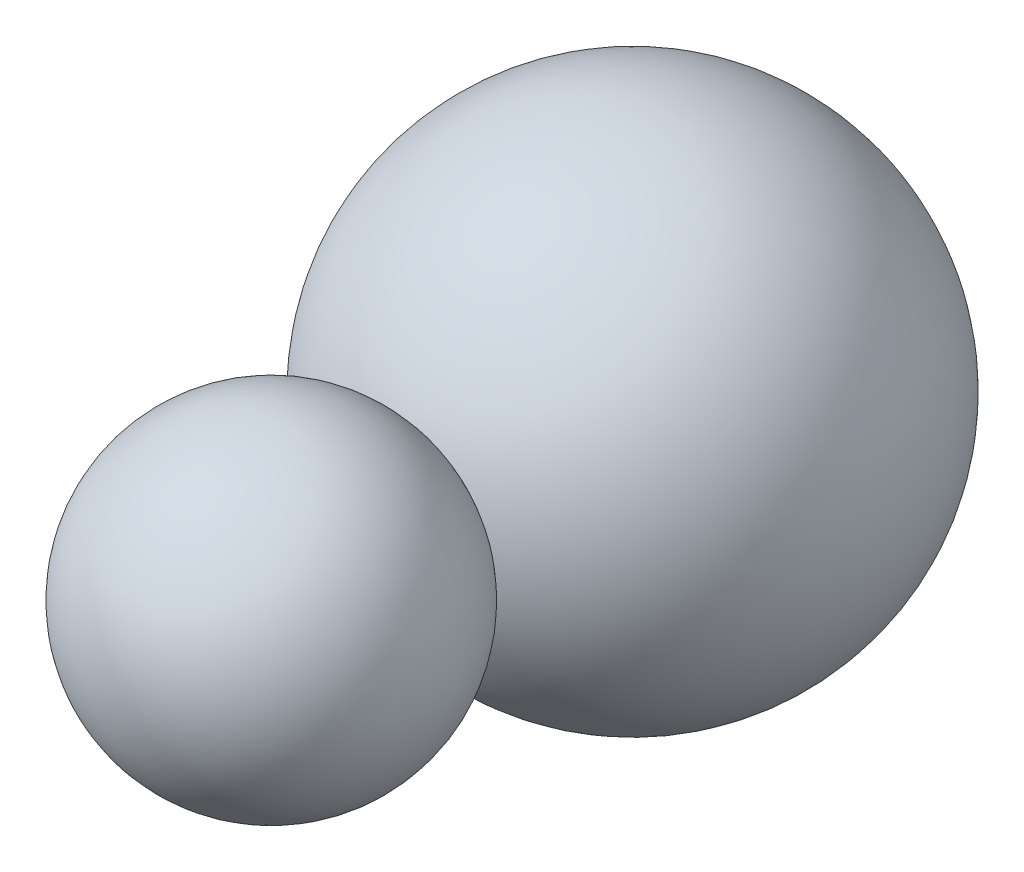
from build123d import *

# Parameters (mm, degrees)
SKETCH2_R          = 4
CUT_EXTRUDE1_DEPTH = 30


with BuildPart() as part:
    # Sketch1 → Revolve1 (revolve)
    with BuildSketch(Plane.XY):
        with BuildLine():
            Line((0, 23), (0, -23))
            ThreePointArc((0, -23), (23, 0), (0, 23))
        make_face()
    revolve(axis=Axis((0, 23, 0), (0, -1, 0)))

    # Sketch2 → Cut-Extrude1 (cut)
    with BuildSketch(Plane.XY):
        Circle(SKETCH2_R)
    extrude(amount=-CUT_EXTRUDE1_DEPTH, mode=Mode.SUBTRACT)

    # Sketch4 → Revolve2 (revolve)
    with BuildSketch(Plane(origin=(0, 0, 0), x_dir=(1, 0, 0), z_dir=(0, 1, 0))):
        with BuildLine():
            Line((0, -19), (0, -49))
            ThreePointArc((0, -49), (15, -34), (0, -19))
        make_face()
    revolve(axis=Axis((0, 0, 19), (0, 0, 1)))


solid = part.part
